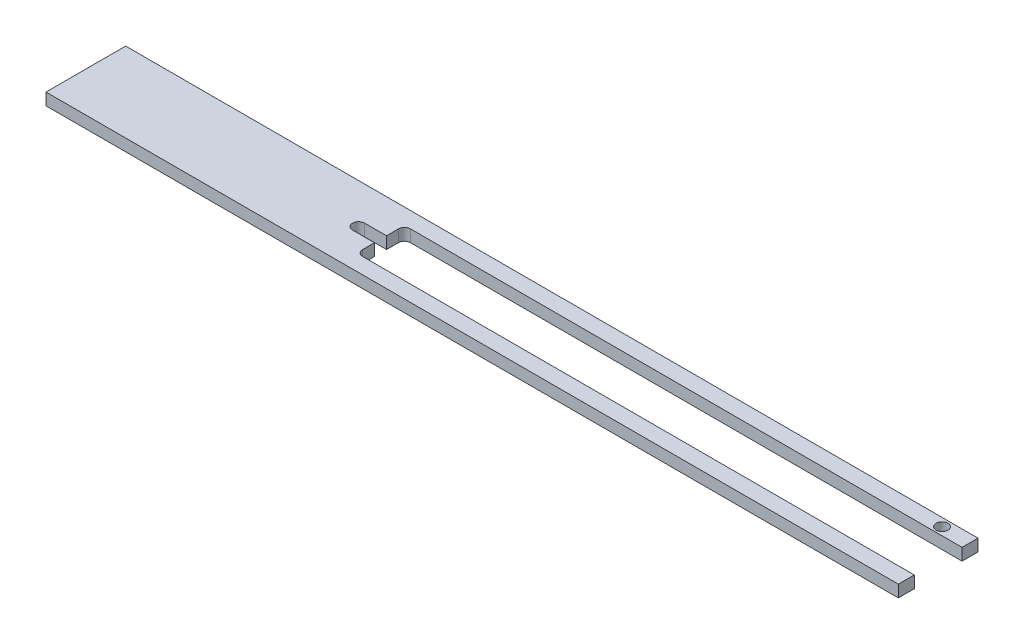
ISO-10303-21;
HEADER;
FILE_DESCRIPTION(('STEP AP214'),'2;1');
FILE_NAME('part.step','',(''),(''),'','','');
FILE_SCHEMA(('AUTOMOTIVE_DESIGN { 1 0 10303 214 1 1 1 1 }'));
ENDSEC;
DATA;
#1=APPLICATION_CONTEXT('core data for automotive mechanical design processes');
#2=APPLICATION_PROTOCOL_DEFINITION('international standard','automotive_design',2000,#1);
#3=PRODUCT_CONTEXT('',#1,'mechanical');
#4=PRODUCT('Part','Part','',(#3));
#5=PRODUCT_RELATED_PRODUCT_CATEGORY('part','',(#4));
#6=PRODUCT_DEFINITION_FORMATION('','',#4);
#7=PRODUCT_DEFINITION_CONTEXT('part definition',#1,'design');
#8=PRODUCT_DEFINITION('design','',#6,#7);
#9=PRODUCT_DEFINITION_SHAPE('','',#8);
#10=(LENGTH_UNIT() NAMED_UNIT(*) SI_UNIT(.MILLI.,.METRE.));
#11=(NAMED_UNIT(*) PLANE_ANGLE_UNIT() SI_UNIT($,.RADIAN.));
#12=(NAMED_UNIT(*) SI_UNIT($,.STERADIAN.) SOLID_ANGLE_UNIT());
#13=UNCERTAINTY_MEASURE_WITH_UNIT(LENGTH_MEASURE(1.E-05),#10,'distance_accuracy_value','');
#14=(GEOMETRIC_REPRESENTATION_CONTEXT(3) GLOBAL_UNCERTAINTY_ASSIGNED_CONTEXT((#13)) GLOBAL_UNIT_ASSIGNED_CONTEXT((#10,
#11,#12)) REPRESENTATION_CONTEXT('',''));
#15=CARTESIAN_POINT('',(0.,0.,0.));
#16=DIRECTION('',(0.,0.,1.));
#17=DIRECTION('',(1.,0.,0.));
#18=AXIS2_PLACEMENT_3D('',#15,#16,#17);
#19=CARTESIAN_POINT('',(-17.2920919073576,1.5,-0.112434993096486));
#20=DIRECTION('',(0.,-1.,0.));
#21=DIRECTION('',(0.,0.,-1.));
#22=AXIS2_PLACEMENT_3D('',#19,#20,#21);
#23=CYLINDRICAL_SURFACE('',#22,0.757171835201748);
#24=CARTESIAN_POINT('',(-17.2920919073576,0.,-0.112434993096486));
#25=DIRECTION('',(0.,1.,0.));
#26=DIRECTION('',(0.,0.,1.));
#27=AXIS2_PLACEMENT_3D('',#24,#25,#26);
#28=CIRCLE('',#27,0.757171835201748);
#29=CARTESIAN_POINT('',(-17.2920919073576,0.,-0.869606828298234));
#30=VERTEX_POINT('',#29);
#31=CARTESIAN_POINT('',(-17.2920919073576,0.,0.644736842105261));
#32=VERTEX_POINT('',#31);
#33=EDGE_CURVE('E171',#30,#32,#28,.T.);
#34=ORIENTED_EDGE('',*,*,#33,.F.);
#35=DIRECTION('',(0.,-1.,0.));
#36=VECTOR('',#35,1.);
#37=CARTESIAN_POINT('',(-17.2920919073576,1.5,-0.869606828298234));
#38=LINE('',#37,#36);
#39=CARTESIAN_POINT('',(-17.2920919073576,1.5,-0.869606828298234));
#40=VERTEX_POINT('',#39);
#41=EDGE_CURVE('E11',#40,#30,#38,.T.);
#42=ORIENTED_EDGE('',*,*,#41,.F.);
#43=CARTESIAN_POINT('',(-17.2920919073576,1.5,-0.112434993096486));
#44=DIRECTION('',(0.,1.,0.));
#45=DIRECTION('',(0.,0.,1.));
#46=AXIS2_PLACEMENT_3D('',#43,#44,#45);
#47=CIRCLE('',#46,0.757171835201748);
#48=CARTESIAN_POINT('',(-17.2920919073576,1.5,0.644736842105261));
#49=VERTEX_POINT('',#48);
#50=EDGE_CURVE('E210',#40,#49,#47,.T.);
#51=ORIENTED_EDGE('',*,*,#50,.T.);
#52=DIRECTION('',(0.,-1.,0.));
#53=VECTOR('',#52,1.);
#54=CARTESIAN_POINT('',(-17.2920919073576,1.5,0.644736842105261));
#55=LINE('',#54,#53);
#56=EDGE_CURVE('E105',#49,#32,#55,.T.);
#57=ORIENTED_EDGE('',*,*,#56,.T.);
#58=EDGE_LOOP('',(#34,#42,#51,#57));
#59=FACE_BOUND('',#58,.T.);
#60=ADVANCED_FACE('F37',(#59),#23,.F.);
#61=CARTESIAN_POINT('',(0.,1.5,-0.869606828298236));
#62=DIRECTION('',(0.,0.,1.));
#63=DIRECTION('',(1.,0.,0.));
#64=AXIS2_PLACEMENT_3D('',#61,#62,#63);
#65=PLANE('',#64);
#66=DIRECTION('',(-1.,0.,0.));
#67=VECTOR('',#66,1.);
#68=CARTESIAN_POINT('',(0.,0.,-0.869606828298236));
#69=LINE('',#68,#67);
#70=CARTESIAN_POINT('',(-14.5420919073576,0.,-0.869606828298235));
#71=VERTEX_POINT('',#70);
#72=EDGE_CURVE('E174',#71,#30,#69,.T.);
#73=ORIENTED_EDGE('',*,*,#72,.F.);
#74=DIRECTION('',(0.,-1.,0.));
#75=VECTOR('',#74,1.);
#76=CARTESIAN_POINT('',(-14.5420919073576,1.5,-0.869606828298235));
#77=LINE('',#76,#75);
#78=CARTESIAN_POINT('',(-14.5420919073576,1.5,-0.869606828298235));
#79=VERTEX_POINT('',#78);
#80=EDGE_CURVE('E45',#79,#71,#77,.T.);
#81=ORIENTED_EDGE('',*,*,#80,.F.);
#82=DIRECTION('',(-1.,0.,0.));
#83=VECTOR('',#82,1.);
#84=CARTESIAN_POINT('',(0.,1.5,-0.869606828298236));
#85=LINE('',#84,#83);
#86=EDGE_CURVE('E253',#79,#40,#85,.T.);
#87=ORIENTED_EDGE('',*,*,#86,.T.);
#88=ORIENTED_EDGE('',*,*,#41,.T.);
#89=EDGE_LOOP('',(#73,#81,#87,#88));
#90=FACE_BOUND('',#89,.T.);
#91=ADVANCED_FACE('F240',(#90),#65,.T.);
#92=CARTESIAN_POINT('',(-14.5420919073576,1.5,0.));
#93=DIRECTION('',(1.,0.,0.));
#94=DIRECTION('',(0.,0.,-1.));
#95=AXIS2_PLACEMENT_3D('',#92,#93,#94);
#96=PLANE('',#95);
#97=DIRECTION('',(0.,0.,1.));
#98=VECTOR('',#97,1.);
#99=CARTESIAN_POINT('',(-14.5420919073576,0.,0.));
#100=LINE('',#99,#98);
#101=CARTESIAN_POINT('',(-14.5420919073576,0.,-2.36960682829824));
#102=VERTEX_POINT('',#101);
#103=EDGE_CURVE('E177',#102,#71,#100,.T.);
#104=ORIENTED_EDGE('',*,*,#103,.F.);
#105=DIRECTION('',(0.,-1.,0.));
#106=VECTOR('',#105,1.);
#107=CARTESIAN_POINT('',(-14.5420919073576,1.5,-2.36960682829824));
#108=LINE('',#107,#106);
#109=CARTESIAN_POINT('',(-14.5420919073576,1.5,-2.36960682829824));
#110=VERTEX_POINT('',#109);
#111=EDGE_CURVE('E229',#110,#102,#108,.T.);
#112=ORIENTED_EDGE('',*,*,#111,.F.);
#113=DIRECTION('',(0.,0.,1.));
#114=VECTOR('',#113,1.);
#115=CARTESIAN_POINT('',(-14.5420919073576,1.5,0.));
#116=LINE('',#115,#114);
#117=EDGE_CURVE('E236',#110,#79,#116,.T.);
#118=ORIENTED_EDGE('',*,*,#117,.T.);
#119=ORIENTED_EDGE('',*,*,#80,.T.);
#120=EDGE_LOOP('',(#104,#112,#118,#119));
#121=FACE_BOUND('',#120,.T.);
#122=ADVANCED_FACE('F234',(#121),#96,.T.);
#123=CARTESIAN_POINT('',(-13.7920919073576,1.5,-2.36960682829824));
#124=DIRECTION('',(0.,-1.,0.));
#125=DIRECTION('',(0.,0.,-1.));
#126=AXIS2_PLACEMENT_3D('',#123,#124,#125);
#127=CYLINDRICAL_SURFACE('',#126,0.749999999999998);
#128=CARTESIAN_POINT('',(-13.7920919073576,0.,-2.36960682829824));
#129=DIRECTION('',(0.,1.,0.));
#130=DIRECTION('',(0.,0.,1.));
#131=AXIS2_PLACEMENT_3D('',#128,#129,#130);
#132=CIRCLE('',#131,0.749999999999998);
#133=CARTESIAN_POINT('',(-13.7920919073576,0.,-3.11960682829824));
#134=VERTEX_POINT('',#133);
#135=EDGE_CURVE('E180',#134,#102,#132,.T.);
#136=ORIENTED_EDGE('',*,*,#135,.F.);
#137=DIRECTION('',(0.,-1.,0.));
#138=VECTOR('',#137,1.);
#139=CARTESIAN_POINT('',(-13.7920919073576,1.5,-3.11960682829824));
#140=LINE('',#139,#138);
#141=CARTESIAN_POINT('',(-13.7920919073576,1.5,-3.11960682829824));
#142=VERTEX_POINT('',#141);
#143=EDGE_CURVE('E227',#142,#134,#140,.T.);
#144=ORIENTED_EDGE('',*,*,#143,.F.);
#145=CARTESIAN_POINT('',(-13.7920919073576,1.5,-2.36960682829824));
#146=DIRECTION('',(0.,1.,0.));
#147=DIRECTION('',(0.,0.,1.));
#148=AXIS2_PLACEMENT_3D('',#145,#146,#147);
#149=CIRCLE('',#148,0.749999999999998);
#150=EDGE_CURVE('E250',#142,#110,#149,.T.);
#151=ORIENTED_EDGE('',*,*,#150,.T.);
#152=ORIENTED_EDGE('',*,*,#111,.T.);
#153=EDGE_LOOP('',(#136,#144,#151,#152));
#154=FACE_BOUND('',#153,.T.);
#155=ADVANCED_FACE('F247',(#154),#127,.F.);
#156=CARTESIAN_POINT('',(0.,1.5,-3.11960682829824));
#157=DIRECTION('',(0.,0.,1.));
#158=DIRECTION('',(1.,0.,0.));
#159=AXIS2_PLACEMENT_3D('',#156,#157,#158);
#160=PLANE('',#159);
#161=DIRECTION('',(-1.,0.,0.));
#162=VECTOR('',#161,1.);
#163=CARTESIAN_POINT('',(0.,0.,-3.11960682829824));
#164=LINE('',#163,#162);
#165=CARTESIAN_POINT('',(55.4579080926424,0.,-3.11960682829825));
#166=VERTEX_POINT('',#165);
#167=EDGE_CURVE('E183',#166,#134,#164,.T.);
#168=ORIENTED_EDGE('',*,*,#167,.F.);
#169=DIRECTION('',(0.,-1.,0.));
#170=VECTOR('',#169,1.);
#171=CARTESIAN_POINT('',(55.4579080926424,1.5,-3.11960682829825));
#172=LINE('',#171,#170);
#173=CARTESIAN_POINT('',(55.4579080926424,1.5,-3.11960682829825));
#174=VERTEX_POINT('',#173);
#175=EDGE_CURVE('E225',#174,#166,#172,.T.);
#176=ORIENTED_EDGE('',*,*,#175,.F.);
#177=DIRECTION('',(-1.,0.,0.));
#178=VECTOR('',#177,1.);
#179=CARTESIAN_POINT('',(0.,1.5,-3.11960682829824));
#180=LINE('',#179,#178);
#181=EDGE_CURVE('E255',#174,#142,#180,.T.);
#182=ORIENTED_EDGE('',*,*,#181,.T.);
#183=ORIENTED_EDGE('',*,*,#143,.T.);
#184=EDGE_LOOP('',(#168,#176,#182,#183));
#185=FACE_BOUND('',#184,.T.);
#186=ADVANCED_FACE('F388',(#185),#160,.T.);
#187=CARTESIAN_POINT('',(55.4579080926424,1.5,0.));
#188=DIRECTION('',(1.,0.,0.));
#189=DIRECTION('',(0.,0.,-1.));
#190=AXIS2_PLACEMENT_3D('',#187,#188,#189);
#191=PLANE('',#190);
#192=DIRECTION('',(0.,0.,1.));
#193=VECTOR('',#192,1.);
#194=CARTESIAN_POINT('',(55.4579080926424,0.,0.));
#195=LINE('',#194,#193);
#196=CARTESIAN_POINT('',(55.4579080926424,0.,-5.11960682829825));
#197=VERTEX_POINT('',#196);
#198=EDGE_CURVE('E186',#197,#166,#195,.T.);
#199=ORIENTED_EDGE('',*,*,#198,.F.);
#200=DIRECTION('',(0.,-1.,0.));
#201=VECTOR('',#200,1.);
#202=CARTESIAN_POINT('',(55.4579080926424,1.5,-5.11960682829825));
#203=LINE('',#202,#201);
#204=CARTESIAN_POINT('',(55.4579080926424,1.5,-5.11960682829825));
#205=VERTEX_POINT('',#204);
#206=EDGE_CURVE('E223',#205,#197,#203,.T.);
#207=ORIENTED_EDGE('',*,*,#206,.F.);
#208=DIRECTION('',(0.,0.,1.));
#209=VECTOR('',#208,1.);
#210=CARTESIAN_POINT('',(55.4579080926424,1.5,0.));
#211=LINE('',#210,#209);
#212=EDGE_CURVE('E261',#205,#174,#211,.T.);
#213=ORIENTED_EDGE('',*,*,#212,.T.);
#214=ORIENTED_EDGE('',*,*,#175,.T.);
#215=EDGE_LOOP('',(#199,#207,#213,#214));
#216=FACE_BOUND('',#215,.T.);
#217=ADVANCED_FACE('F379',(#216),#191,.T.);
#218=CARTESIAN_POINT('',(0.,1.5,-5.11960682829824));
#219=DIRECTION('',(0.,0.,-1.));
#220=DIRECTION('',(-1.,0.,0.));
#221=AXIS2_PLACEMENT_3D('',#218,#219,#220);
#222=PLANE('',#221);
#223=DIRECTION('',(1.,0.,0.));
#224=VECTOR('',#223,1.);
#225=CARTESIAN_POINT('',(0.,0.,-5.11960682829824));
#226=LINE('',#225,#224);
#227=CARTESIAN_POINT('',(-51.5420919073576,0.,-5.11960682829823));
#228=VERTEX_POINT('',#227);
#229=EDGE_CURVE('E189',#228,#197,#226,.T.);
#230=ORIENTED_EDGE('',*,*,#229,.F.);
#231=DIRECTION('',(0.,-1.,0.));
#232=VECTOR('',#231,1.);
#233=CARTESIAN_POINT('',(-51.5420919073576,1.5,-5.11960682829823));
#234=LINE('',#233,#232);
#235=CARTESIAN_POINT('',(-51.5420919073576,1.5,-5.11960682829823));
#236=VERTEX_POINT('',#235);
#237=EDGE_CURVE('E221',#236,#228,#234,.T.);
#238=ORIENTED_EDGE('',*,*,#237,.F.);
#239=DIRECTION('',(1.,0.,0.));
#240=VECTOR('',#239,1.);
#241=CARTESIAN_POINT('',(0.,1.5,-5.11960682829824));
#242=LINE('',#241,#240);
#243=EDGE_CURVE('E264',#236,#205,#242,.T.);
#244=ORIENTED_EDGE('',*,*,#243,.T.);
#245=ORIENTED_EDGE('',*,*,#206,.T.);
#246=EDGE_LOOP('',(#230,#238,#244,#245));
#247=FACE_BOUND('',#246,.T.);
#248=ADVANCED_FACE('F370',(#247),#222,.T.);
#249=CARTESIAN_POINT('',(-51.5420919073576,1.5,0.));
#250=DIRECTION('',(1.,0.,0.));
#251=DIRECTION('',(0.,0.,-1.));
#252=AXIS2_PLACEMENT_3D('',#249,#250,#251);
#253=PLANE('',#252);
#254=DIRECTION('',(0.,0.,1.));
#255=VECTOR('',#254,1.);
#256=CARTESIAN_POINT('',(-51.5420919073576,0.,0.));
#257=LINE('',#256,#255);
#258=CARTESIAN_POINT('',(-51.5420919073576,0.,4.88039317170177));
#259=VERTEX_POINT('',#258);
#260=EDGE_CURVE('E192',#228,#259,#257,.T.);
#261=ORIENTED_EDGE('',*,*,#260,.T.);
#262=DIRECTION('',(0.,-1.,0.));
#263=VECTOR('',#262,1.);
#264=CARTESIAN_POINT('',(-51.5420919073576,1.5,4.88039317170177));
#265=LINE('',#264,#263);
#266=CARTESIAN_POINT('',(-51.5420919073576,1.5,4.88039317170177));
#267=VERTEX_POINT('',#266);
#268=EDGE_CURVE('E218',#267,#259,#265,.T.);
#269=ORIENTED_EDGE('',*,*,#268,.F.);
#270=DIRECTION('',(0.,0.,1.));
#271=VECTOR('',#270,1.);
#272=CARTESIAN_POINT('',(-51.5420919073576,1.5,0.));
#273=LINE('',#272,#271);
#274=EDGE_CURVE('E267',#236,#267,#273,.T.);
#275=ORIENTED_EDGE('',*,*,#274,.F.);
#276=ORIENTED_EDGE('',*,*,#237,.T.);
#277=EDGE_LOOP('',(#261,#269,#275,#276));
#278=FACE_BOUND('',#277,.T.);
#279=ADVANCED_FACE('F362',(#278),#253,.F.);
#280=CARTESIAN_POINT('',(0.,1.5,4.88039317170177));
#281=DIRECTION('',(0.,0.,-1.));
#282=DIRECTION('',(-1.,0.,0.));
#283=AXIS2_PLACEMENT_3D('',#280,#281,#282);
#284=PLANE('',#283);
#285=DIRECTION('',(1.,0.,0.));
#286=VECTOR('',#285,1.);
#287=CARTESIAN_POINT('',(0.,0.,4.88039317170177));
#288=LINE('',#287,#286);
#289=CARTESIAN_POINT('',(55.4579080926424,0.,4.88039317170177));
#290=VERTEX_POINT('',#289);
#291=EDGE_CURVE('E194',#259,#290,#288,.T.);
#292=ORIENTED_EDGE('',*,*,#291,.T.);
#293=DIRECTION('',(0.,-1.,0.));
#294=VECTOR('',#293,1.);
#295=CARTESIAN_POINT('',(55.4579080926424,1.5,4.88039317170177));
#296=LINE('',#295,#294);
#297=CARTESIAN_POINT('',(55.4579080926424,1.5,4.88039317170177));
#298=VERTEX_POINT('',#297);
#299=EDGE_CURVE('E216',#298,#290,#296,.T.);
#300=ORIENTED_EDGE('',*,*,#299,.F.);
#301=DIRECTION('',(1.,0.,0.));
#302=VECTOR('',#301,1.);
#303=CARTESIAN_POINT('',(0.,1.5,4.88039317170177));
#304=LINE('',#303,#302);
#305=EDGE_CURVE('E269',#267,#298,#304,.T.);
#306=ORIENTED_EDGE('',*,*,#305,.F.);
#307=ORIENTED_EDGE('',*,*,#268,.T.);
#308=EDGE_LOOP('',(#292,#300,#306,#307));
#309=FACE_BOUND('',#308,.T.);
#310=ADVANCED_FACE('F282',(#309),#284,.F.);
#311=CARTESIAN_POINT('',(55.4579080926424,1.5,-1.92408270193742E-13));
#312=DIRECTION('',(1.,0.,0.));
#313=DIRECTION('',(0.,0.,-1.));
#314=AXIS2_PLACEMENT_3D('',#311,#312,#313);
#315=PLANE('',#314);
#316=DIRECTION('',(0.,0.,1.));
#317=VECTOR('',#316,1.);
#318=CARTESIAN_POINT('',(55.4579080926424,0.,-1.92408270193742E-13));
#319=LINE('',#318,#317);
#320=CARTESIAN_POINT('',(55.4579080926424,0.,2.88039317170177));
#321=VERTEX_POINT('',#320);
#322=EDGE_CURVE('E197',#321,#290,#319,.T.);
#323=ORIENTED_EDGE('',*,*,#322,.F.);
#324=DIRECTION('',(0.,-1.,0.));
#325=VECTOR('',#324,1.);
#326=CARTESIAN_POINT('',(55.4579080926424,1.5,2.88039317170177));
#327=LINE('',#326,#325);
#328=CARTESIAN_POINT('',(55.4579080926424,1.5,2.88039317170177));
#329=VERTEX_POINT('',#328);
#330=EDGE_CURVE('E214',#329,#321,#327,.T.);
#331=ORIENTED_EDGE('',*,*,#330,.F.);
#332=DIRECTION('',(0.,0.,1.));
#333=VECTOR('',#332,1.);
#334=CARTESIAN_POINT('',(55.4579080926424,1.5,-1.92408270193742E-13));
#335=LINE('',#334,#333);
#336=EDGE_CURVE('E271',#329,#298,#335,.T.);
#337=ORIENTED_EDGE('',*,*,#336,.T.);
#338=ORIENTED_EDGE('',*,*,#299,.T.);
#339=EDGE_LOOP('',(#323,#331,#337,#338));
#340=FACE_BOUND('',#339,.T.);
#341=ADVANCED_FACE('F275',(#340),#315,.T.);
#342=CARTESIAN_POINT('',(0.,1.5,2.88039317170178));
#343=DIRECTION('',(0.,0.,1.));
#344=DIRECTION('',(1.,0.,0.));
#345=AXIS2_PLACEMENT_3D('',#342,#343,#344);
#346=PLANE('',#345);
#347=DIRECTION('',(-1.,0.,0.));
#348=VECTOR('',#347,1.);
#349=CARTESIAN_POINT('',(0.,0.,2.88039317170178));
#350=LINE('',#349,#348);
#351=CARTESIAN_POINT('',(-13.7920919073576,0.,2.88039317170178));
#352=VERTEX_POINT('',#351);
#353=EDGE_CURVE('E200',#321,#352,#350,.T.);
#354=ORIENTED_EDGE('',*,*,#353,.T.);
#355=DIRECTION('',(0.,-1.,0.));
#356=VECTOR('',#355,1.);
#357=CARTESIAN_POINT('',(-13.7920919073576,1.5,2.88039317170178));
#358=LINE('',#357,#356);
#359=CARTESIAN_POINT('',(-13.7920919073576,1.5,2.88039317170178));
#360=VERTEX_POINT('',#359);
#361=EDGE_CURVE('E161',#360,#352,#358,.T.);
#362=ORIENTED_EDGE('',*,*,#361,.F.);
#363=DIRECTION('',(-1.,0.,0.));
#364=VECTOR('',#363,1.);
#365=CARTESIAN_POINT('',(0.,1.5,2.88039317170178));
#366=LINE('',#365,#364);
#367=EDGE_CURVE('E148',#329,#360,#366,.T.);
#368=ORIENTED_EDGE('',*,*,#367,.F.);
#369=ORIENTED_EDGE('',*,*,#330,.T.);
#370=EDGE_LOOP('',(#354,#362,#368,#369));
#371=FACE_BOUND('',#370,.T.);
#372=ADVANCED_FACE('F287',(#371),#346,.F.);
#373=CARTESIAN_POINT('',(-13.7920919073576,1.5,2.13039317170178));
#374=DIRECTION('',(0.,-1.,0.));
#375=DIRECTION('',(0.,0.,-1.));
#376=AXIS2_PLACEMENT_3D('',#373,#374,#375);
#377=CYLINDRICAL_SURFACE('',#376,0.750000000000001);
#378=CARTESIAN_POINT('',(-13.7920919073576,0.,2.13039317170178));
#379=DIRECTION('',(0.,1.,0.));
#380=DIRECTION('',(0.,0.,1.));
#381=AXIS2_PLACEMENT_3D('',#378,#379,#380);
#382=CIRCLE('',#381,0.750000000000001);
#383=CARTESIAN_POINT('',(-14.5420919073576,0.,2.13039317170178));
#384=VERTEX_POINT('',#383);
#385=EDGE_CURVE('E157',#352,#384,#382,.F.);
#386=ORIENTED_EDGE('',*,*,#385,.T.);
#387=DIRECTION('',(0.,-1.,0.));
#388=VECTOR('',#387,1.);
#389=CARTESIAN_POINT('',(-14.5420919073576,1.5,2.13039317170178));
#390=LINE('',#389,#388);
#391=CARTESIAN_POINT('',(-14.5420919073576,1.5,2.13039317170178));
#392=VERTEX_POINT('',#391);
#393=EDGE_CURVE('E154',#392,#384,#390,.T.);
#394=ORIENTED_EDGE('',*,*,#393,.F.);
#395=CARTESIAN_POINT('',(-13.7920919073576,1.5,2.13039317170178));
#396=DIRECTION('',(0.,1.,0.));
#397=DIRECTION('',(0.,0.,1.));
#398=AXIS2_PLACEMENT_3D('',#395,#396,#397);
#399=CIRCLE('',#398,0.750000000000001);
#400=EDGE_CURVE('E140',#360,#392,#399,.F.);
#401=ORIENTED_EDGE('',*,*,#400,.F.);
#402=ORIENTED_EDGE('',*,*,#361,.T.);
#403=EDGE_LOOP('',(#386,#394,#401,#402));
#404=FACE_BOUND('',#403,.T.);
#405=ADVANCED_FACE('F155',(#404),#377,.F.);
#406=CARTESIAN_POINT('',(-14.5420919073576,1.5,0.));
#407=DIRECTION('',(1.,0.,0.));
#408=DIRECTION('',(0.,0.,-1.));
#409=AXIS2_PLACEMENT_3D('',#406,#407,#408);
#410=PLANE('',#409);
#411=DIRECTION('',(0.,0.,1.));
#412=VECTOR('',#411,1.);
#413=CARTESIAN_POINT('',(-14.5420919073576,0.,0.));
#414=LINE('',#413,#412);
#415=CARTESIAN_POINT('',(-14.5420919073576,0.,0.644736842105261));
#416=VERTEX_POINT('',#415);
#417=EDGE_CURVE('E203',#416,#384,#414,.T.);
#418=ORIENTED_EDGE('',*,*,#417,.F.);
#419=DIRECTION('',(0.,-1.,0.));
#420=VECTOR('',#419,1.);
#421=CARTESIAN_POINT('',(-14.5420919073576,1.5,0.644736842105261));
#422=LINE('',#421,#420);
#423=CARTESIAN_POINT('',(-14.5420919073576,1.5,0.644736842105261));
#424=VERTEX_POINT('',#423);
#425=EDGE_CURVE('E98',#424,#416,#422,.T.);
#426=ORIENTED_EDGE('',*,*,#425,.F.);
#427=DIRECTION('',(0.,0.,1.));
#428=VECTOR('',#427,1.);
#429=CARTESIAN_POINT('',(-14.5420919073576,1.5,0.));
#430=LINE('',#429,#428);
#431=EDGE_CURVE('E145',#424,#392,#430,.T.);
#432=ORIENTED_EDGE('',*,*,#431,.T.);
#433=ORIENTED_EDGE('',*,*,#393,.T.);
#434=EDGE_LOOP('',(#418,#426,#432,#433));
#435=FACE_BOUND('',#434,.T.);
#436=ADVANCED_FACE('F163',(#435),#410,.T.);
#437=CARTESIAN_POINT('',(0.,1.5,0.644736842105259));
#438=DIRECTION('',(0.,0.,1.));
#439=DIRECTION('',(1.,0.,0.));
#440=AXIS2_PLACEMENT_3D('',#437,#438,#439);
#441=PLANE('',#440);
#442=DIRECTION('',(-1.,0.,0.));
#443=VECTOR('',#442,1.);
#444=CARTESIAN_POINT('',(0.,0.,0.644736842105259));
#445=LINE('',#444,#443);
#446=EDGE_CURVE('E205',#416,#32,#445,.T.);
#447=ORIENTED_EDGE('',*,*,#446,.T.);
#448=ORIENTED_EDGE('',*,*,#56,.F.);
#449=DIRECTION('',(-1.,0.,0.));
#450=VECTOR('',#449,1.);
#451=CARTESIAN_POINT('',(0.,1.5,0.644736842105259));
#452=LINE('',#451,#450);
#453=EDGE_CURVE('E53',#424,#49,#452,.T.);
#454=ORIENTED_EDGE('',*,*,#453,.F.);
#455=ORIENTED_EDGE('',*,*,#425,.T.);
#456=EDGE_LOOP('',(#447,#448,#454,#455));
#457=FACE_BOUND('',#456,.T.);
#458=ADVANCED_FACE('F300',(#457),#441,.F.);
#459=CARTESIAN_POINT('',(51.9579080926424,1.5,-4.10526315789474));
#460=DIRECTION('',(0.,-1.,0.));
#461=DIRECTION('',(0.,0.,-1.));
#462=AXIS2_PLACEMENT_3D('',#459,#460,#461);
#463=CYLINDRICAL_SURFACE('',#462,0.749999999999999);
#464=CARTESIAN_POINT('',(51.9579080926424,1.5,-4.10526315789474));
#465=DIRECTION('',(0.,1.,0.));
#466=DIRECTION('',(0.,0.,1.));
#467=AXIS2_PLACEMENT_3D('',#464,#465,#466);
#468=CIRCLE('',#467,0.749999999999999);
#469=CARTESIAN_POINT('',(51.9579080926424,1.5,-3.35526315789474));
#470=VERTEX_POINT('',#469);
#471=EDGE_CURVE('E165',#470,#470,#468,.T.);
#472=ORIENTED_EDGE('',*,*,#471,.T.);
#473=EDGE_LOOP('',(#472));
#474=FACE_BOUND('',#473,.T.);
#475=CARTESIAN_POINT('',(51.9579080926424,0.,-4.10526315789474));
#476=DIRECTION('',(0.,1.,0.));
#477=DIRECTION('',(0.,0.,1.));
#478=AXIS2_PLACEMENT_3D('',#475,#476,#477);
#479=CIRCLE('',#478,0.749999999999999);
#480=CARTESIAN_POINT('',(51.9579080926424,0.,-3.35526315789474));
#481=VERTEX_POINT('',#480);
#482=EDGE_CURVE('E207',#481,#481,#479,.T.);
#483=ORIENTED_EDGE('',*,*,#482,.F.);
#484=EDGE_LOOP('',(#483));
#485=FACE_BOUND('',#484,.T.);
#486=ADVANCED_FACE('F302',(#474,#485),#463,.F.);
#487=CARTESIAN_POINT('',(0.,1.5,0.));
#488=DIRECTION('',(0.,1.,0.));
#489=DIRECTION('',(0.,0.,1.));
#490=AXIS2_PLACEMENT_3D('',#487,#488,#489);
#491=PLANE('',#490);
#492=ORIENTED_EDGE('',*,*,#50,.F.);
#493=ORIENTED_EDGE('',*,*,#86,.F.);
#494=ORIENTED_EDGE('',*,*,#117,.F.);
#495=ORIENTED_EDGE('',*,*,#150,.F.);
#496=ORIENTED_EDGE('',*,*,#181,.F.);
#497=ORIENTED_EDGE('',*,*,#212,.F.);
#498=ORIENTED_EDGE('',*,*,#243,.F.);
#499=ORIENTED_EDGE('',*,*,#274,.T.);
#500=ORIENTED_EDGE('',*,*,#305,.T.);
#501=ORIENTED_EDGE('',*,*,#336,.F.);
#502=ORIENTED_EDGE('',*,*,#367,.T.);
#503=ORIENTED_EDGE('',*,*,#400,.T.);
#504=ORIENTED_EDGE('',*,*,#431,.F.);
#505=ORIENTED_EDGE('',*,*,#453,.T.);
#506=EDGE_LOOP('',(#492,#493,#494,#495,#496,#497,#498,#499,#500,#501,#502,#503,#504,#505));
#507=FACE_BOUND('',#506,.T.);
#508=ORIENTED_EDGE('',*,*,#471,.F.);
#509=EDGE_LOOP('',(#508));
#510=FACE_BOUND('',#509,.T.);
#511=ADVANCED_FACE('F142',(#507,#510),#491,.T.);
#512=CARTESIAN_POINT('',(0.,0.,0.));
#513=DIRECTION('',(0.,1.,0.));
#514=DIRECTION('',(0.,0.,1.));
#515=AXIS2_PLACEMENT_3D('',#512,#513,#514);
#516=PLANE('',#515);
#517=ORIENTED_EDGE('',*,*,#33,.T.);
#518=ORIENTED_EDGE('',*,*,#446,.F.);
#519=ORIENTED_EDGE('',*,*,#417,.T.);
#520=ORIENTED_EDGE('',*,*,#385,.F.);
#521=ORIENTED_EDGE('',*,*,#353,.F.);
#522=ORIENTED_EDGE('',*,*,#322,.T.);
#523=ORIENTED_EDGE('',*,*,#291,.F.);
#524=ORIENTED_EDGE('',*,*,#260,.F.);
#525=ORIENTED_EDGE('',*,*,#229,.T.);
#526=ORIENTED_EDGE('',*,*,#198,.T.);
#527=ORIENTED_EDGE('',*,*,#167,.T.);
#528=ORIENTED_EDGE('',*,*,#135,.T.);
#529=ORIENTED_EDGE('',*,*,#103,.T.);
#530=ORIENTED_EDGE('',*,*,#72,.T.);
#531=EDGE_LOOP('',(#517,#518,#519,#520,#521,#522,#523,#524,#525,#526,#527,#528,#529,#530));
#532=FACE_BOUND('',#531,.T.);
#533=ORIENTED_EDGE('',*,*,#482,.T.);
#534=EDGE_LOOP('',(#533));
#535=FACE_BOUND('',#534,.T.);
#536=ADVANCED_FACE('F242',(#532,#535),#516,.F.);
#537=CLOSED_SHELL('',(#60,#91,#122,#155,#186,#217,#248,#279,#310,#341,#372,#405,#436,#458,#486,
#511,#536));
#538=MANIFOLD_SOLID_BREP('B2',#537);
#539=ADVANCED_BREP_SHAPE_REPRESENTATION('',(#18,#538),#14);
#540=SHAPE_DEFINITION_REPRESENTATION(#9,#539);
ENDSEC;
END-ISO-10303-21;
